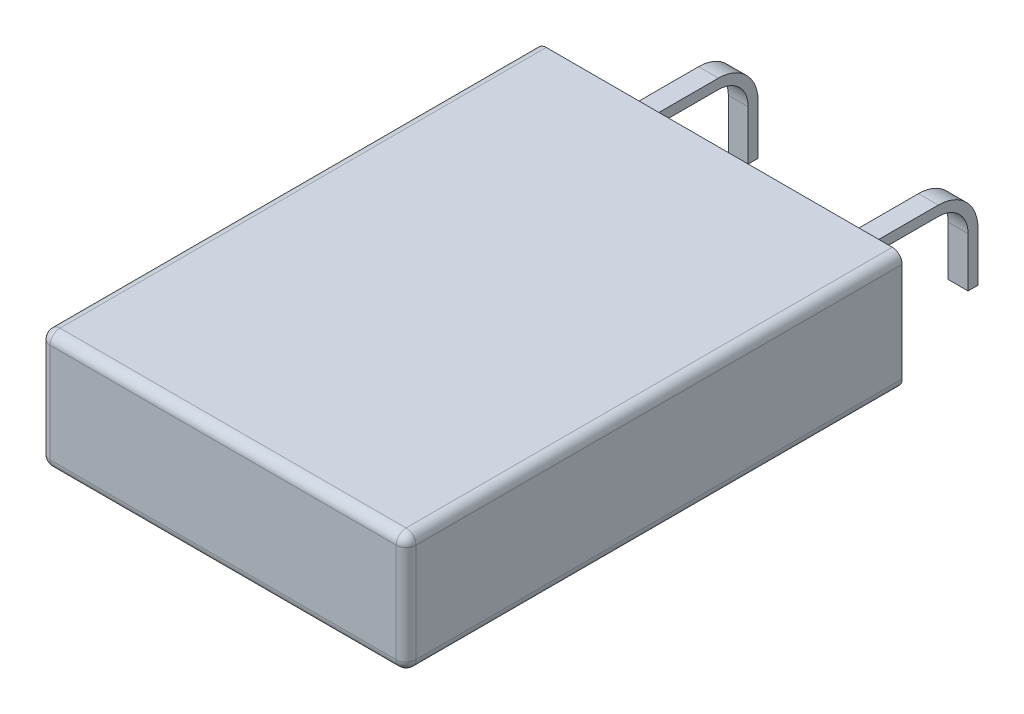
ISO-10303-21;
HEADER;
FILE_DESCRIPTION(('STEP AP214'),'2;1');
FILE_NAME('part.step','',(''),(''),'','','');
FILE_SCHEMA(('AUTOMOTIVE_DESIGN { 1 0 10303 214 1 1 1 1 }'));
ENDSEC;
DATA;
#1=APPLICATION_CONTEXT('core data for automotive mechanical design processes');
#2=APPLICATION_PROTOCOL_DEFINITION('international standard','automotive_design',2000,#1);
#3=PRODUCT_CONTEXT('',#1,'mechanical');
#4=PRODUCT('Part','Part','',(#3));
#5=PRODUCT_RELATED_PRODUCT_CATEGORY('part','',(#4));
#6=PRODUCT_DEFINITION_FORMATION('','',#4);
#7=PRODUCT_DEFINITION_CONTEXT('part definition',#1,'design');
#8=PRODUCT_DEFINITION('design','',#6,#7);
#9=PRODUCT_DEFINITION_SHAPE('','',#8);
#10=(LENGTH_UNIT() NAMED_UNIT(*) SI_UNIT(.MILLI.,.METRE.));
#11=(NAMED_UNIT(*) PLANE_ANGLE_UNIT() SI_UNIT($,.RADIAN.));
#12=(NAMED_UNIT(*) SI_UNIT($,.STERADIAN.) SOLID_ANGLE_UNIT());
#13=UNCERTAINTY_MEASURE_WITH_UNIT(LENGTH_MEASURE(1.E-05),#10,'distance_accuracy_value','');
#14=(GEOMETRIC_REPRESENTATION_CONTEXT(3) GLOBAL_UNCERTAINTY_ASSIGNED_CONTEXT((#13)) GLOBAL_UNIT_ASSIGNED_CONTEXT((#10,
#11,#12)) REPRESENTATION_CONTEXT('',''));
#15=CARTESIAN_POINT('',(0.,0.,0.));
#16=DIRECTION('',(0.,0.,1.));
#17=DIRECTION('',(1.,0.,0.));
#18=AXIS2_PLACEMENT_3D('',#15,#16,#17);
#19=CARTESIAN_POINT('',(17.94,5.5,-25.));
#20=DIRECTION('',(0.,0.,1.));
#21=DIRECTION('',(1.,0.,0.));
#22=AXIS2_PLACEMENT_3D('',#19,#20,#21);
#23=CYLINDRICAL_SURFACE('',#22,0.5);
#24=DIRECTION('',(0.,0.,1.));
#25=VECTOR('',#24,1.);
#26=CARTESIAN_POINT('',(17.94,6.,-25.));
#27=LINE('',#26,#25);
#28=CARTESIAN_POINT('',(17.94,6.,-25.));
#29=VERTEX_POINT('',#28);
#30=CARTESIAN_POINT('',(17.94,6.,-0.5));
#31=VERTEX_POINT('',#30);
#32=EDGE_CURVE('E423',#29,#31,#27,.T.);
#33=ORIENTED_EDGE('',*,*,#32,.T.);
#34=CARTESIAN_POINT('',(17.94,5.5,-0.5));
#35=DIRECTION('',(0.,0.,1.));
#36=DIRECTION('',(1.,0.,0.));
#37=AXIS2_PLACEMENT_3D('',#34,#35,#36);
#38=CIRCLE('',#37,0.5);
#39=CARTESIAN_POINT('',(18.44,5.5,-0.5));
#40=VERTEX_POINT('',#39);
#41=EDGE_CURVE('E427',#31,#40,#38,.F.);
#42=ORIENTED_EDGE('',*,*,#41,.T.);
#43=DIRECTION('',(0.,0.,1.));
#44=VECTOR('',#43,1.);
#45=CARTESIAN_POINT('',(18.44,5.5,-25.));
#46=LINE('',#45,#44);
#47=CARTESIAN_POINT('',(18.44,5.5,-25.));
#48=VERTEX_POINT('',#47);
#49=EDGE_CURVE('E424',#48,#40,#46,.T.);
#50=ORIENTED_EDGE('',*,*,#49,.F.);
#51=CARTESIAN_POINT('',(17.94,5.5,-25.));
#52=DIRECTION('',(0.,0.,1.));
#53=DIRECTION('',(-1.,0.,0.));
#54=AXIS2_PLACEMENT_3D('',#51,#52,#53);
#55=CIRCLE('',#54,0.5);
#56=EDGE_CURVE('E399',#48,#29,#55,.T.);
#57=ORIENTED_EDGE('',*,*,#56,.T.);
#58=EDGE_LOOP('',(#33,#42,#50,#57));
#59=FACE_BOUND('',#58,.T.);
#60=ADVANCED_FACE('F34',(#59),#23,.T.);
#61=CARTESIAN_POINT('',(18.44,0.500000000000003,-25.));
#62=DIRECTION('',(1.,0.,0.));
#63=DIRECTION('',(0.,0.,-1.));
#64=AXIS2_PLACEMENT_3D('',#61,#62,#63);
#65=PLANE('',#64);
#66=ORIENTED_EDGE('',*,*,#49,.T.);
#67=DIRECTION('',(0.,1.,0.));
#68=VECTOR('',#67,1.);
#69=CARTESIAN_POINT('',(18.44,0.500000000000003,-0.5));
#70=LINE('',#69,#68);
#71=CARTESIAN_POINT('',(18.44,0.500000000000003,-0.5));
#72=VERTEX_POINT('',#71);
#73=EDGE_CURVE('E459',#40,#72,#70,.F.);
#74=ORIENTED_EDGE('',*,*,#73,.T.);
#75=DIRECTION('',(0.,0.,1.));
#76=VECTOR('',#75,1.);
#77=CARTESIAN_POINT('',(18.44,0.500000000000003,-25.));
#78=LINE('',#77,#76);
#79=CARTESIAN_POINT('',(18.44,0.500000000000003,-25.));
#80=VERTEX_POINT('',#79);
#81=EDGE_CURVE('E428',#80,#72,#78,.T.);
#82=ORIENTED_EDGE('',*,*,#81,.F.);
#83=DIRECTION('',(0.,1.,0.));
#84=VECTOR('',#83,1.);
#85=CARTESIAN_POINT('',(18.44,0.500000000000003,-25.));
#86=LINE('',#85,#84);
#87=EDGE_CURVE('E420',#80,#48,#86,.T.);
#88=ORIENTED_EDGE('',*,*,#87,.T.);
#89=EDGE_LOOP('',(#66,#74,#82,#88));
#90=FACE_BOUND('',#89,.T.);
#91=ADVANCED_FACE('F536',(#90),#65,.T.);
#92=CARTESIAN_POINT('',(17.94,0.5,-25.));
#93=DIRECTION('',(0.,0.,1.));
#94=DIRECTION('',(1.,0.,0.));
#95=AXIS2_PLACEMENT_3D('',#92,#93,#94);
#96=CYLINDRICAL_SURFACE('',#95,0.5);
#97=ORIENTED_EDGE('',*,*,#81,.T.);
#98=CARTESIAN_POINT('',(17.94,0.5,-0.5));
#99=DIRECTION('',(0.,0.,1.));
#100=DIRECTION('',(1.,0.,0.));
#101=AXIS2_PLACEMENT_3D('',#98,#99,#100);
#102=CIRCLE('',#101,0.5);
#103=CARTESIAN_POINT('',(17.94,0.,-0.5));
#104=VERTEX_POINT('',#103);
#105=EDGE_CURVE('E461',#72,#104,#102,.F.);
#106=ORIENTED_EDGE('',*,*,#105,.T.);
#107=DIRECTION('',(0.,0.,1.));
#108=VECTOR('',#107,1.);
#109=CARTESIAN_POINT('',(17.94,0.,-25.));
#110=LINE('',#109,#108);
#111=CARTESIAN_POINT('',(17.94,0.,-25.));
#112=VERTEX_POINT('',#111);
#113=EDGE_CURVE('E431',#112,#104,#110,.T.);
#114=ORIENTED_EDGE('',*,*,#113,.F.);
#115=CARTESIAN_POINT('',(17.94,0.5,-25.));
#116=DIRECTION('',(0.,0.,1.));
#117=DIRECTION('',(1.,0.,0.));
#118=AXIS2_PLACEMENT_3D('',#115,#116,#117);
#119=CIRCLE('',#118,0.5);
#120=EDGE_CURVE('E417',#112,#80,#119,.T.);
#121=ORIENTED_EDGE('',*,*,#120,.T.);
#122=EDGE_LOOP('',(#97,#106,#114,#121));
#123=FACE_BOUND('',#122,.T.);
#124=ADVANCED_FACE('F542',(#123),#96,.T.);
#125=CARTESIAN_POINT('',(0.500000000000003,0.,-25.));
#126=DIRECTION('',(0.,-1.,0.));
#127=DIRECTION('',(0.,0.,-1.));
#128=AXIS2_PLACEMENT_3D('',#125,#126,#127);
#129=PLANE('',#128);
#130=ORIENTED_EDGE('',*,*,#113,.T.);
#131=DIRECTION('',(1.,0.,0.));
#132=VECTOR('',#131,1.);
#133=CARTESIAN_POINT('',(0.500000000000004,0.,-0.5));
#134=LINE('',#133,#132);
#135=CARTESIAN_POINT('',(0.500000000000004,0.,-0.5));
#136=VERTEX_POINT('',#135);
#137=EDGE_CURVE('E463',#104,#136,#134,.F.);
#138=ORIENTED_EDGE('',*,*,#137,.T.);
#139=DIRECTION('',(0.,0.,1.));
#140=VECTOR('',#139,1.);
#141=CARTESIAN_POINT('',(0.500000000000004,0.,-25.));
#142=LINE('',#141,#140);
#143=CARTESIAN_POINT('',(0.500000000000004,0.,-25.));
#144=VERTEX_POINT('',#143);
#145=EDGE_CURVE('E434',#144,#136,#142,.T.);
#146=ORIENTED_EDGE('',*,*,#145,.F.);
#147=DIRECTION('',(1.,0.,0.));
#148=VECTOR('',#147,1.);
#149=CARTESIAN_POINT('',(0.500000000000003,0.,-25.));
#150=LINE('',#149,#148);
#151=EDGE_CURVE('E414',#144,#112,#150,.T.);
#152=ORIENTED_EDGE('',*,*,#151,.T.);
#153=EDGE_LOOP('',(#130,#138,#146,#152));
#154=FACE_BOUND('',#153,.T.);
#155=ADVANCED_FACE('F541',(#154),#129,.T.);
#156=CARTESIAN_POINT('',(0.5,0.5,-25.));
#157=DIRECTION('',(0.,0.,1.));
#158=DIRECTION('',(1.,0.,0.));
#159=AXIS2_PLACEMENT_3D('',#156,#157,#158);
#160=CYLINDRICAL_SURFACE('',#159,0.5);
#161=ORIENTED_EDGE('',*,*,#145,.T.);
#162=CARTESIAN_POINT('',(0.5,0.5,-0.5));
#163=DIRECTION('',(0.,0.,1.));
#164=DIRECTION('',(1.,0.,0.));
#165=AXIS2_PLACEMENT_3D('',#162,#163,#164);
#166=CIRCLE('',#165,0.5);
#167=CARTESIAN_POINT('',(0.,0.500000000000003,-0.5));
#168=VERTEX_POINT('',#167);
#169=EDGE_CURVE('E465',#136,#168,#166,.F.);
#170=ORIENTED_EDGE('',*,*,#169,.T.);
#171=DIRECTION('',(0.,0.,1.));
#172=VECTOR('',#171,1.);
#173=CARTESIAN_POINT('',(0.,0.500000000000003,-25.));
#174=LINE('',#173,#172);
#175=CARTESIAN_POINT('',(0.,0.500000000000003,-25.));
#176=VERTEX_POINT('',#175);
#177=EDGE_CURVE('E437',#176,#168,#174,.T.);
#178=ORIENTED_EDGE('',*,*,#177,.F.);
#179=CARTESIAN_POINT('',(0.5,0.5,-25.));
#180=DIRECTION('',(0.,0.,1.));
#181=DIRECTION('',(-1.,0.,0.));
#182=AXIS2_PLACEMENT_3D('',#179,#180,#181);
#183=CIRCLE('',#182,0.5);
#184=EDGE_CURVE('E411',#176,#144,#183,.T.);
#185=ORIENTED_EDGE('',*,*,#184,.T.);
#186=EDGE_LOOP('',(#161,#170,#178,#185));
#187=FACE_BOUND('',#186,.T.);
#188=ADVANCED_FACE('F500',(#187),#160,.T.);
#189=CARTESIAN_POINT('',(0.,0.500000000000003,-25.));
#190=DIRECTION('',(-1.,0.,0.));
#191=DIRECTION('',(0.,0.,1.));
#192=AXIS2_PLACEMENT_3D('',#189,#190,#191);
#193=PLANE('',#192);
#194=ORIENTED_EDGE('',*,*,#177,.T.);
#195=DIRECTION('',(0.,-1.,0.));
#196=VECTOR('',#195,1.);
#197=CARTESIAN_POINT('',(0.,5.5,-0.5));
#198=LINE('',#197,#196);
#199=CARTESIAN_POINT('',(0.,5.5,-0.5));
#200=VERTEX_POINT('',#199);
#201=EDGE_CURVE('E467',#168,#200,#198,.F.);
#202=ORIENTED_EDGE('',*,*,#201,.T.);
#203=DIRECTION('',(0.,0.,1.));
#204=VECTOR('',#203,1.);
#205=CARTESIAN_POINT('',(0.,5.5,-25.));
#206=LINE('',#205,#204);
#207=CARTESIAN_POINT('',(0.,5.5,-25.));
#208=VERTEX_POINT('',#207);
#209=EDGE_CURVE('E440',#208,#200,#206,.T.);
#210=ORIENTED_EDGE('',*,*,#209,.F.);
#211=DIRECTION('',(0.,-1.,0.));
#212=VECTOR('',#211,1.);
#213=CARTESIAN_POINT('',(0.,0.500000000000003,-25.));
#214=LINE('',#213,#212);
#215=EDGE_CURVE('E408',#208,#176,#214,.T.);
#216=ORIENTED_EDGE('',*,*,#215,.T.);
#217=EDGE_LOOP('',(#194,#202,#210,#216));
#218=FACE_BOUND('',#217,.T.);
#219=ADVANCED_FACE('F503',(#218),#193,.T.);
#220=CARTESIAN_POINT('',(0.5,5.5,-25.));
#221=DIRECTION('',(0.,0.,1.));
#222=DIRECTION('',(1.,0.,0.));
#223=AXIS2_PLACEMENT_3D('',#220,#221,#222);
#224=CYLINDRICAL_SURFACE('',#223,0.5);
#225=ORIENTED_EDGE('',*,*,#209,.T.);
#226=CARTESIAN_POINT('',(0.5,5.5,-0.5));
#227=DIRECTION('',(0.,0.,1.));
#228=DIRECTION('',(1.,0.,0.));
#229=AXIS2_PLACEMENT_3D('',#226,#227,#228);
#230=CIRCLE('',#229,0.5);
#231=CARTESIAN_POINT('',(0.500000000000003,6.,-0.5));
#232=VERTEX_POINT('',#231);
#233=EDGE_CURVE('E43',#200,#232,#230,.F.);
#234=ORIENTED_EDGE('',*,*,#233,.T.);
#235=DIRECTION('',(0.,0.,1.));
#236=VECTOR('',#235,1.);
#237=CARTESIAN_POINT('',(0.500000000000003,6.,-25.));
#238=LINE('',#237,#236);
#239=CARTESIAN_POINT('',(0.500000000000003,6.,-25.));
#240=VERTEX_POINT('',#239);
#241=EDGE_CURVE('E443',#240,#232,#238,.T.);
#242=ORIENTED_EDGE('',*,*,#241,.F.);
#243=CARTESIAN_POINT('',(0.5,5.5,-25.));
#244=DIRECTION('',(0.,0.,1.));
#245=DIRECTION('',(-1.,0.,0.));
#246=AXIS2_PLACEMENT_3D('',#243,#244,#245);
#247=CIRCLE('',#246,0.5);
#248=EDGE_CURVE('E405',#240,#208,#247,.T.);
#249=ORIENTED_EDGE('',*,*,#248,.T.);
#250=EDGE_LOOP('',(#225,#234,#242,#249));
#251=FACE_BOUND('',#250,.T.);
#252=ADVANCED_FACE('F512',(#251),#224,.T.);
#253=CARTESIAN_POINT('',(0.500000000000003,6.,-25.));
#254=DIRECTION('',(0.,1.,0.));
#255=DIRECTION('',(0.,0.,1.));
#256=AXIS2_PLACEMENT_3D('',#253,#254,#255);
#257=PLANE('',#256);
#258=ORIENTED_EDGE('',*,*,#241,.T.);
#259=DIRECTION('',(-1.,0.,0.));
#260=VECTOR('',#259,1.);
#261=CARTESIAN_POINT('',(17.94,6.,-0.5));
#262=LINE('',#261,#260);
#263=EDGE_CURVE('E11',#232,#31,#262,.F.);
#264=ORIENTED_EDGE('',*,*,#263,.T.);
#265=ORIENTED_EDGE('',*,*,#32,.F.);
#266=DIRECTION('',(-1.,0.,0.));
#267=VECTOR('',#266,1.);
#268=CARTESIAN_POINT('',(0.500000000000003,6.,-25.));
#269=LINE('',#268,#267);
#270=EDGE_CURVE('E402',#29,#240,#269,.T.);
#271=ORIENTED_EDGE('',*,*,#270,.T.);
#272=EDGE_LOOP('',(#258,#264,#265,#271));
#273=FACE_BOUND('',#272,.T.);
#274=ADVANCED_FACE('F517',(#273),#257,.T.);
#275=CARTESIAN_POINT('',(17.94,5.5,-25.));
#276=DIRECTION('',(0.,0.,-1.));
#277=DIRECTION('',(-1.,0.,0.));
#278=AXIS2_PLACEMENT_3D('',#275,#276,#277);
#279=PLANE('',#278);
#280=DIRECTION('',(1.,0.,0.));
#281=VECTOR('',#280,1.);
#282=CARTESIAN_POINT('',(1.,5.,-25.));
#283=LINE('',#282,#281);
#284=CARTESIAN_POINT('',(1.,5.,-25.));
#285=VERTEX_POINT('',#284);
#286=CARTESIAN_POINT('',(17.44,5.,-25.));
#287=VERTEX_POINT('',#286);
#288=EDGE_CURVE('E366',#285,#287,#283,.T.);
#289=ORIENTED_EDGE('',*,*,#288,.F.);
#290=DIRECTION('',(0.,1.,0.));
#291=VECTOR('',#290,1.);
#292=CARTESIAN_POINT('',(1.,1.,-25.));
#293=LINE('',#292,#291);
#294=CARTESIAN_POINT('',(1.,1.,-25.));
#295=VERTEX_POINT('',#294);
#296=EDGE_CURVE('E371',#295,#285,#293,.T.);
#297=ORIENTED_EDGE('',*,*,#296,.F.);
#298=DIRECTION('',(-1.,0.,0.));
#299=VECTOR('',#298,1.);
#300=CARTESIAN_POINT('',(17.44,1.,-25.));
#301=LINE('',#300,#299);
#302=CARTESIAN_POINT('',(17.44,1.,-25.));
#303=VERTEX_POINT('',#302);
#304=EDGE_CURVE('E385',#303,#295,#301,.T.);
#305=ORIENTED_EDGE('',*,*,#304,.F.);
#306=DIRECTION('',(0.,-1.,0.));
#307=VECTOR('',#306,1.);
#308=CARTESIAN_POINT('',(17.44,5.,-25.));
#309=LINE('',#308,#307);
#310=EDGE_CURVE('E382',#287,#303,#309,.T.);
#311=ORIENTED_EDGE('',*,*,#310,.F.);
#312=EDGE_LOOP('',(#289,#297,#305,#311));
#313=FACE_BOUND('',#312,.T.);
#314=ORIENTED_EDGE('',*,*,#56,.F.);
#315=ORIENTED_EDGE('',*,*,#87,.F.);
#316=ORIENTED_EDGE('',*,*,#120,.F.);
#317=ORIENTED_EDGE('',*,*,#151,.F.);
#318=ORIENTED_EDGE('',*,*,#184,.F.);
#319=ORIENTED_EDGE('',*,*,#215,.F.);
#320=ORIENTED_EDGE('',*,*,#248,.F.);
#321=ORIENTED_EDGE('',*,*,#270,.F.);
#322=EDGE_LOOP('',(#314,#315,#316,#317,#318,#319,#320,#321));
#323=FACE_BOUND('',#322,.T.);
#324=ADVANCED_FACE('F508',(#313,#323),#279,.T.);
#325=CARTESIAN_POINT('',(17.94,5.5,0.));
#326=DIRECTION('',(0.,0.,-1.));
#327=DIRECTION('',(-1.,0.,0.));
#328=AXIS2_PLACEMENT_3D('',#325,#326,#327);
#329=PLANE('',#328);
#330=DIRECTION('',(1.,0.,0.));
#331=VECTOR('',#330,1.);
#332=CARTESIAN_POINT('',(17.94,0.5,0.));
#333=LINE('',#332,#331);
#334=CARTESIAN_POINT('',(0.5,0.5,0.));
#335=VERTEX_POINT('',#334);
#336=CARTESIAN_POINT('',(17.94,0.5,0.));
#337=VERTEX_POINT('',#336);
#338=EDGE_CURVE('E454',#335,#337,#333,.T.);
#339=ORIENTED_EDGE('',*,*,#338,.T.);
#340=DIRECTION('',(0.,1.,0.));
#341=VECTOR('',#340,1.);
#342=CARTESIAN_POINT('',(17.94,5.5,0.));
#343=LINE('',#342,#341);
#344=CARTESIAN_POINT('',(17.94,5.5,0.));
#345=VERTEX_POINT('',#344);
#346=EDGE_CURVE('E456',#337,#345,#343,.T.);
#347=ORIENTED_EDGE('',*,*,#346,.T.);
#348=DIRECTION('',(-1.,0.,0.));
#349=VECTOR('',#348,1.);
#350=CARTESIAN_POINT('',(0.500000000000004,5.5,0.));
#351=LINE('',#350,#349);
#352=CARTESIAN_POINT('',(0.5,5.5,0.));
#353=VERTEX_POINT('',#352);
#354=EDGE_CURVE('E450',#345,#353,#351,.T.);
#355=ORIENTED_EDGE('',*,*,#354,.T.);
#356=DIRECTION('',(0.,-1.,0.));
#357=VECTOR('',#356,1.);
#358=CARTESIAN_POINT('',(0.5,0.500000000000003,0.));
#359=LINE('',#358,#357);
#360=EDGE_CURVE('E452',#353,#335,#359,.T.);
#361=ORIENTED_EDGE('',*,*,#360,.T.);
#362=EDGE_LOOP('',(#339,#347,#355,#361));
#363=FACE_BOUND('',#362,.T.);
#364=ADVANCED_FACE('F864',(#363),#329,.F.);
#365=CARTESIAN_POINT('',(0.5,0.5,-0.5));
#366=DIRECTION('',(0.,0.,1.));
#367=DIRECTION('',(1.,0.,0.));
#368=AXIS2_PLACEMENT_3D('',#365,#366,#367);
#369=SPHERICAL_SURFACE('',#368,0.5);
#370=CARTESIAN_POINT('',(0.5,0.5,-0.5));
#371=DIRECTION('',(0.,1.,0.));
#372=DIRECTION('',(-1.,0.,0.));
#373=AXIS2_PLACEMENT_3D('',#370,#371,#372);
#374=CIRCLE('',#373,0.5);
#375=EDGE_CURVE('E484',#168,#335,#374,.T.);
#376=ORIENTED_EDGE('',*,*,#375,.F.);
#377=ORIENTED_EDGE('',*,*,#169,.F.);
#378=CARTESIAN_POINT('',(0.5,0.5,-0.5));
#379=DIRECTION('',(1.,0.,0.));
#380=DIRECTION('',(0.,1.,0.));
#381=AXIS2_PLACEMENT_3D('',#378,#379,#380);
#382=CIRCLE('',#381,0.5);
#383=EDGE_CURVE('E38',#335,#136,#382,.T.);
#384=ORIENTED_EDGE('',*,*,#383,.F.);
#385=EDGE_LOOP('',(#376,#377,#384));
#386=FACE_BOUND('',#385,.T.);
#387=ADVANCED_FACE('F36',(#386),#369,.T.);
#388=CARTESIAN_POINT('',(17.94,0.5,-0.5));
#389=DIRECTION('',(-1.,0.,0.));
#390=DIRECTION('',(0.,0.,1.));
#391=AXIS2_PLACEMENT_3D('',#388,#389,#390);
#392=CYLINDRICAL_SURFACE('',#391,0.5);
#393=ORIENTED_EDGE('',*,*,#383,.T.);
#394=ORIENTED_EDGE('',*,*,#137,.F.);
#395=CARTESIAN_POINT('',(17.94,0.5,-0.5));
#396=DIRECTION('',(1.,0.,0.));
#397=DIRECTION('',(0.,1.,0.));
#398=AXIS2_PLACEMENT_3D('',#395,#396,#397);
#399=CIRCLE('',#398,0.5);
#400=EDGE_CURVE('E482',#337,#104,#399,.T.);
#401=ORIENTED_EDGE('',*,*,#400,.F.);
#402=ORIENTED_EDGE('',*,*,#338,.F.);
#403=EDGE_LOOP('',(#393,#394,#401,#402));
#404=FACE_BOUND('',#403,.T.);
#405=ADVANCED_FACE('F495',(#404),#392,.T.);
#406=CARTESIAN_POINT('',(0.5,5.5,-0.5));
#407=DIRECTION('',(0.,1.,0.));
#408=DIRECTION('',(0.,0.,1.));
#409=AXIS2_PLACEMENT_3D('',#406,#407,#408);
#410=CYLINDRICAL_SURFACE('',#409,0.5);
#411=ORIENTED_EDGE('',*,*,#375,.T.);
#412=ORIENTED_EDGE('',*,*,#360,.F.);
#413=CARTESIAN_POINT('',(0.5,5.5,-0.5));
#414=DIRECTION('',(0.,1.,0.));
#415=DIRECTION('',(0.,0.,1.));
#416=AXIS2_PLACEMENT_3D('',#413,#414,#415);
#417=CIRCLE('',#416,0.5);
#418=EDGE_CURVE('E479',#200,#353,#417,.T.);
#419=ORIENTED_EDGE('',*,*,#418,.F.);
#420=ORIENTED_EDGE('',*,*,#201,.F.);
#421=EDGE_LOOP('',(#411,#412,#419,#420));
#422=FACE_BOUND('',#421,.T.);
#423=ADVANCED_FACE('F547',(#422),#410,.T.);
#424=CARTESIAN_POINT('',(17.94,0.5,-0.5));
#425=DIRECTION('',(0.,0.,1.));
#426=DIRECTION('',(1.,0.,0.));
#427=AXIS2_PLACEMENT_3D('',#424,#425,#426);
#428=SPHERICAL_SURFACE('',#427,0.5);
#429=ORIENTED_EDGE('',*,*,#400,.T.);
#430=ORIENTED_EDGE('',*,*,#105,.F.);
#431=CARTESIAN_POINT('',(17.94,0.5,-0.5));
#432=DIRECTION('',(0.,1.,0.));
#433=DIRECTION('',(-1.,0.,0.));
#434=AXIS2_PLACEMENT_3D('',#431,#432,#433);
#435=CIRCLE('',#434,0.5);
#436=EDGE_CURVE('E476',#337,#72,#435,.T.);
#437=ORIENTED_EDGE('',*,*,#436,.F.);
#438=EDGE_LOOP('',(#429,#430,#437));
#439=FACE_BOUND('',#438,.T.);
#440=ADVANCED_FACE('F545',(#439),#428,.T.);
#441=CARTESIAN_POINT('',(0.5,5.5,-0.5));
#442=DIRECTION('',(0.,0.,1.));
#443=DIRECTION('',(1.,0.,0.));
#444=AXIS2_PLACEMENT_3D('',#441,#442,#443);
#445=SPHERICAL_SURFACE('',#444,0.5);
#446=ORIENTED_EDGE('',*,*,#233,.F.);
#447=ORIENTED_EDGE('',*,*,#418,.T.);
#448=CARTESIAN_POINT('',(0.5,5.5,-0.5));
#449=DIRECTION('',(1.,0.,0.));
#450=DIRECTION('',(0.,1.,0.));
#451=AXIS2_PLACEMENT_3D('',#448,#449,#450);
#452=CIRCLE('',#451,0.5);
#453=EDGE_CURVE('E473',#232,#353,#452,.T.);
#454=ORIENTED_EDGE('',*,*,#453,.F.);
#455=EDGE_LOOP('',(#446,#447,#454));
#456=FACE_BOUND('',#455,.T.);
#457=ADVANCED_FACE('F520',(#456),#445,.T.);
#458=CARTESIAN_POINT('',(17.94,5.5,-0.5));
#459=DIRECTION('',(0.,-1.,0.));
#460=DIRECTION('',(0.,0.,-1.));
#461=AXIS2_PLACEMENT_3D('',#458,#459,#460);
#462=CYLINDRICAL_SURFACE('',#461,0.5);
#463=ORIENTED_EDGE('',*,*,#436,.T.);
#464=ORIENTED_EDGE('',*,*,#73,.F.);
#465=CARTESIAN_POINT('',(17.94,5.5,-0.5));
#466=DIRECTION('',(0.,1.,0.));
#467=DIRECTION('',(-1.,0.,0.));
#468=AXIS2_PLACEMENT_3D('',#465,#466,#467);
#469=CIRCLE('',#468,0.5);
#470=EDGE_CURVE('E471',#345,#40,#469,.T.);
#471=ORIENTED_EDGE('',*,*,#470,.F.);
#472=ORIENTED_EDGE('',*,*,#346,.F.);
#473=EDGE_LOOP('',(#463,#464,#471,#472));
#474=FACE_BOUND('',#473,.T.);
#475=ADVANCED_FACE('F532',(#474),#462,.T.);
#476=CARTESIAN_POINT('',(17.94,5.5,-0.5));
#477=DIRECTION('',(1.,0.,0.));
#478=DIRECTION('',(0.,0.,-1.));
#479=AXIS2_PLACEMENT_3D('',#476,#477,#478);
#480=CYLINDRICAL_SURFACE('',#479,0.5);
#481=ORIENTED_EDGE('',*,*,#453,.T.);
#482=ORIENTED_EDGE('',*,*,#354,.F.);
#483=CARTESIAN_POINT('',(17.94,5.5,-0.5));
#484=DIRECTION('',(1.,0.,0.));
#485=DIRECTION('',(0.,0.,-1.));
#486=AXIS2_PLACEMENT_3D('',#483,#484,#485);
#487=CIRCLE('',#486,0.5);
#488=EDGE_CURVE('E392',#31,#345,#487,.T.);
#489=ORIENTED_EDGE('',*,*,#488,.F.);
#490=ORIENTED_EDGE('',*,*,#263,.F.);
#491=EDGE_LOOP('',(#481,#482,#489,#490));
#492=FACE_BOUND('',#491,.T.);
#493=ADVANCED_FACE('F524',(#492),#480,.T.);
#494=CARTESIAN_POINT('',(17.94,5.5,-0.5));
#495=DIRECTION('',(0.,0.,1.));
#496=DIRECTION('',(1.,0.,0.));
#497=AXIS2_PLACEMENT_3D('',#494,#495,#496);
#498=SPHERICAL_SURFACE('',#497,0.5);
#499=ORIENTED_EDGE('',*,*,#470,.T.);
#500=ORIENTED_EDGE('',*,*,#41,.F.);
#501=ORIENTED_EDGE('',*,*,#488,.T.);
#502=EDGE_LOOP('',(#499,#500,#501));
#503=FACE_BOUND('',#502,.T.);
#504=ADVANCED_FACE('F528',(#503),#498,.T.);
#505=CARTESIAN_POINT('',(1.,5.,-20.));
#506=DIRECTION('',(0.,1.,0.));
#507=DIRECTION('',(0.,0.,1.));
#508=AXIS2_PLACEMENT_3D('',#505,#506,#507);
#509=PLANE('',#508);
#510=ORIENTED_EDGE('',*,*,#288,.T.);
#511=DIRECTION('',(0.,0.,-1.));
#512=VECTOR('',#511,1.);
#513=CARTESIAN_POINT('',(17.44,5.,-20.));
#514=LINE('',#513,#512);
#515=CARTESIAN_POINT('',(17.44,5.,-20.));
#516=VERTEX_POINT('',#515);
#517=EDGE_CURVE('E380',#516,#287,#514,.T.);
#518=ORIENTED_EDGE('',*,*,#517,.F.);
#519=DIRECTION('',(1.,0.,0.));
#520=VECTOR('',#519,1.);
#521=CARTESIAN_POINT('',(1.,5.,-20.));
#522=LINE('',#521,#520);
#523=CARTESIAN_POINT('',(1.,5.,-20.));
#524=VERTEX_POINT('',#523);
#525=EDGE_CURVE('E367',#524,#516,#522,.T.);
#526=ORIENTED_EDGE('',*,*,#525,.F.);
#527=DIRECTION('',(0.,0.,-1.));
#528=VECTOR('',#527,1.);
#529=CARTESIAN_POINT('',(1.,5.,-20.));
#530=LINE('',#529,#528);
#531=EDGE_CURVE('E390',#524,#285,#530,.T.);
#532=ORIENTED_EDGE('',*,*,#531,.T.);
#533=EDGE_LOOP('',(#510,#518,#526,#532));
#534=FACE_BOUND('',#533,.T.);
#535=ADVANCED_FACE('F566',(#534),#509,.F.);
#536=CARTESIAN_POINT('',(1.,1.,-20.));
#537=DIRECTION('',(-1.,0.,0.));
#538=DIRECTION('',(0.,0.,1.));
#539=AXIS2_PLACEMENT_3D('',#536,#537,#538);
#540=PLANE('',#539);
#541=ORIENTED_EDGE('',*,*,#296,.T.);
#542=ORIENTED_EDGE('',*,*,#531,.F.);
#543=DIRECTION('',(0.,1.,0.));
#544=VECTOR('',#543,1.);
#545=CARTESIAN_POINT('',(1.,1.,-20.));
#546=LINE('',#545,#544);
#547=CARTESIAN_POINT('',(1.,1.,-20.));
#548=VERTEX_POINT('',#547);
#549=EDGE_CURVE('E377',#548,#524,#546,.T.);
#550=ORIENTED_EDGE('',*,*,#549,.F.);
#551=DIRECTION('',(0.,0.,-1.));
#552=VECTOR('',#551,1.);
#553=CARTESIAN_POINT('',(1.,1.,-20.));
#554=LINE('',#553,#552);
#555=EDGE_CURVE('E393',#548,#295,#554,.T.);
#556=ORIENTED_EDGE('',*,*,#555,.T.);
#557=EDGE_LOOP('',(#541,#542,#550,#556));
#558=FACE_BOUND('',#557,.T.);
#559=ADVANCED_FACE('F589',(#558),#540,.F.);
#560=CARTESIAN_POINT('',(17.44,1.,-20.));
#561=DIRECTION('',(0.,-1.,0.));
#562=DIRECTION('',(0.,0.,-1.));
#563=AXIS2_PLACEMENT_3D('',#560,#561,#562);
#564=PLANE('',#563);
#565=ORIENTED_EDGE('',*,*,#304,.T.);
#566=ORIENTED_EDGE('',*,*,#555,.F.);
#567=DIRECTION('',(-1.,0.,0.));
#568=VECTOR('',#567,1.);
#569=CARTESIAN_POINT('',(17.44,1.,-20.));
#570=LINE('',#569,#568);
#571=CARTESIAN_POINT('',(17.44,1.,-20.));
#572=VERTEX_POINT('',#571);
#573=EDGE_CURVE('E374',#572,#548,#570,.T.);
#574=ORIENTED_EDGE('',*,*,#573,.F.);
#575=DIRECTION('',(0.,0.,-1.));
#576=VECTOR('',#575,1.);
#577=CARTESIAN_POINT('',(17.44,1.,-20.));
#578=LINE('',#577,#576);
#579=EDGE_CURVE('E395',#572,#303,#578,.T.);
#580=ORIENTED_EDGE('',*,*,#579,.T.);
#581=EDGE_LOOP('',(#565,#566,#574,#580));
#582=FACE_BOUND('',#581,.T.);
#583=ADVANCED_FACE('F597',(#582),#564,.F.);
#584=CARTESIAN_POINT('',(17.44,5.,-20.));
#585=DIRECTION('',(1.,0.,0.));
#586=DIRECTION('',(0.,0.,-1.));
#587=AXIS2_PLACEMENT_3D('',#584,#585,#586);
#588=PLANE('',#587);
#589=ORIENTED_EDGE('',*,*,#310,.T.);
#590=ORIENTED_EDGE('',*,*,#579,.F.);
#591=DIRECTION('',(0.,-1.,0.));
#592=VECTOR('',#591,1.);
#593=CARTESIAN_POINT('',(17.44,5.,-20.));
#594=LINE('',#593,#592);
#595=EDGE_CURVE('E370',#516,#572,#594,.T.);
#596=ORIENTED_EDGE('',*,*,#595,.F.);
#597=ORIENTED_EDGE('',*,*,#517,.T.);
#598=EDGE_LOOP('',(#589,#590,#596,#597));
#599=FACE_BOUND('',#598,.T.);
#600=ADVANCED_FACE('F605',(#599),#588,.F.);
#601=CARTESIAN_POINT('',(17.44,5.,-20.));
#602=DIRECTION('',(0.,0.,-1.));
#603=DIRECTION('',(-1.,0.,0.));
#604=AXIS2_PLACEMENT_3D('',#601,#602,#603);
#605=PLANE('',#604);
#606=DIRECTION('',(1.,0.,0.));
#607=VECTOR('',#606,1.);
#608=CARTESIAN_POINT('',(3.18,4.,-20.));
#609=LINE('',#608,#607);
#610=CARTESIAN_POINT('',(3.18,4.,-20.));
#611=VERTEX_POINT('',#610);
#612=CARTESIAN_POINT('',(4.18,4.,-20.));
#613=VERTEX_POINT('',#612);
#614=EDGE_CURVE('E51',#611,#613,#609,.T.);
#615=ORIENTED_EDGE('',*,*,#614,.F.);
#616=DIRECTION('',(0.,1.,0.));
#617=VECTOR('',#616,1.);
#618=CARTESIAN_POINT('',(3.18,4.,-20.));
#619=LINE('',#618,#617);
#620=CARTESIAN_POINT('',(3.18,3.5,-20.));
#621=VERTEX_POINT('',#620);
#622=EDGE_CURVE('E252',#621,#611,#619,.T.);
#623=ORIENTED_EDGE('',*,*,#622,.F.);
#624=DIRECTION('',(-1.,0.,0.));
#625=VECTOR('',#624,1.);
#626=CARTESIAN_POINT('',(3.18,3.5,-20.));
#627=LINE('',#626,#625);
#628=CARTESIAN_POINT('',(4.18,3.5,-20.));
#629=VERTEX_POINT('',#628);
#630=EDGE_CURVE('E957',#629,#621,#627,.T.);
#631=ORIENTED_EDGE('',*,*,#630,.F.);
#632=DIRECTION('',(0.,-1.,0.));
#633=VECTOR('',#632,1.);
#634=CARTESIAN_POINT('',(4.18,4.,-20.));
#635=LINE('',#634,#633);
#636=EDGE_CURVE('E56',#613,#629,#635,.T.);
#637=ORIENTED_EDGE('',*,*,#636,.F.);
#638=EDGE_LOOP('',(#615,#623,#631,#637));
#639=FACE_BOUND('',#638,.T.);
#640=DIRECTION('',(0.,-1.,0.));
#641=VECTOR('',#640,1.);
#642=CARTESIAN_POINT('',(15.26,4.,-20.));
#643=LINE('',#642,#641);
#644=CARTESIAN_POINT('',(15.26,4.,-20.));
#645=VERTEX_POINT('',#644);
#646=CARTESIAN_POINT('',(15.26,3.5,-20.));
#647=VERTEX_POINT('',#646);
#648=EDGE_CURVE('E294',#645,#647,#643,.T.);
#649=ORIENTED_EDGE('',*,*,#648,.F.);
#650=DIRECTION('',(1.,0.,0.));
#651=VECTOR('',#650,1.);
#652=CARTESIAN_POINT('',(15.26,4.,-20.));
#653=LINE('',#652,#651);
#654=CARTESIAN_POINT('',(14.26,4.,-20.));
#655=VERTEX_POINT('',#654);
#656=EDGE_CURVE('E299',#655,#645,#653,.T.);
#657=ORIENTED_EDGE('',*,*,#656,.F.);
#658=DIRECTION('',(0.,1.,0.));
#659=VECTOR('',#658,1.);
#660=CARTESIAN_POINT('',(14.26,4.,-20.));
#661=LINE('',#660,#659);
#662=CARTESIAN_POINT('',(14.26,3.5,-20.));
#663=VERTEX_POINT('',#662);
#664=EDGE_CURVE('E308',#663,#655,#661,.T.);
#665=ORIENTED_EDGE('',*,*,#664,.F.);
#666=DIRECTION('',(-1.,0.,0.));
#667=VECTOR('',#666,1.);
#668=CARTESIAN_POINT('',(15.26,3.5,-20.));
#669=LINE('',#668,#667);
#670=EDGE_CURVE('E305',#647,#663,#669,.T.);
#671=ORIENTED_EDGE('',*,*,#670,.F.);
#672=EDGE_LOOP('',(#649,#657,#665,#671));
#673=FACE_BOUND('',#672,.T.);
#674=ORIENTED_EDGE('',*,*,#525,.T.);
#675=ORIENTED_EDGE('',*,*,#595,.T.);
#676=ORIENTED_EDGE('',*,*,#573,.T.);
#677=ORIENTED_EDGE('',*,*,#549,.T.);
#678=EDGE_LOOP('',(#674,#675,#676,#677));
#679=FACE_BOUND('',#678,.T.);
#680=ADVANCED_FACE('F613',(#639,#673,#679),#605,.T.);
#681=CARTESIAN_POINT('',(15.26,1.99999999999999,-31.5));
#682=DIRECTION('',(0.,0.,1.));
#683=DIRECTION('',(1.,0.,0.));
#684=AXIS2_PLACEMENT_3D('',#681,#682,#683);
#685=PLANE('',#684);
#686=DIRECTION('',(-1.,0.,0.));
#687=VECTOR('',#686,1.);
#688=CARTESIAN_POINT('',(15.26,1.99999999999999,-31.5));
#689=LINE('',#688,#687);
#690=CARTESIAN_POINT('',(15.26,1.99999999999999,-31.5));
#691=VERTEX_POINT('',#690);
#692=CARTESIAN_POINT('',(14.26,1.99999999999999,-31.5));
#693=VERTEX_POINT('',#692);
#694=EDGE_CURVE('E327',#691,#693,#689,.T.);
#695=ORIENTED_EDGE('',*,*,#694,.T.);
#696=DIRECTION('',(0.,-1.,0.));
#697=VECTOR('',#696,1.);
#698=CARTESIAN_POINT('',(14.26,1.99999999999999,-31.5));
#699=LINE('',#698,#697);
#700=CARTESIAN_POINT('',(14.26,-0.499999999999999,-31.5));
#701=VERTEX_POINT('',#700);
#702=EDGE_CURVE('E360',#693,#701,#699,.T.);
#703=ORIENTED_EDGE('',*,*,#702,.T.);
#704=DIRECTION('',(-1.,0.,0.));
#705=VECTOR('',#704,1.);
#706=CARTESIAN_POINT('',(15.26,-0.499999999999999,-31.5));
#707=LINE('',#706,#705);
#708=CARTESIAN_POINT('',(15.26,-0.499999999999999,-31.5));
#709=VERTEX_POINT('',#708);
#710=EDGE_CURVE('E351',#709,#701,#707,.T.);
#711=ORIENTED_EDGE('',*,*,#710,.F.);
#712=DIRECTION('',(0.,-1.,0.));
#713=VECTOR('',#712,1.);
#714=CARTESIAN_POINT('',(15.26,1.99999999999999,-31.5));
#715=LINE('',#714,#713);
#716=EDGE_CURVE('E363',#691,#709,#715,.T.);
#717=ORIENTED_EDGE('',*,*,#716,.F.);
#718=EDGE_LOOP('',(#695,#703,#711,#717));
#719=FACE_BOUND('',#718,.T.);
#720=ADVANCED_FACE('F622',(#719),#685,.T.);
#721=CARTESIAN_POINT('',(15.26,1.99999999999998,-32.));
#722=DIRECTION('',(0.,0.,-1.));
#723=DIRECTION('',(-1.,0.,0.));
#724=AXIS2_PLACEMENT_3D('',#721,#722,#723);
#725=PLANE('',#724);
#726=DIRECTION('',(1.,0.,0.));
#727=VECTOR('',#726,1.);
#728=CARTESIAN_POINT('',(15.26,1.99999999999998,-32.));
#729=LINE('',#728,#727);
#730=CARTESIAN_POINT('',(14.26,1.99999999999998,-32.));
#731=VERTEX_POINT('',#730);
#732=CARTESIAN_POINT('',(15.26,1.99999999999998,-32.));
#733=VERTEX_POINT('',#732);
#734=EDGE_CURVE('E324',#731,#733,#729,.T.);
#735=ORIENTED_EDGE('',*,*,#734,.T.);
#736=DIRECTION('',(0.,-1.,0.));
#737=VECTOR('',#736,1.);
#738=CARTESIAN_POINT('',(15.26,1.99999999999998,-32.));
#739=LINE('',#738,#737);
#740=CARTESIAN_POINT('',(15.26,-0.500000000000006,-32.));
#741=VERTEX_POINT('',#740);
#742=EDGE_CURVE('E354',#733,#741,#739,.T.);
#743=ORIENTED_EDGE('',*,*,#742,.T.);
#744=DIRECTION('',(1.,0.,0.));
#745=VECTOR('',#744,1.);
#746=CARTESIAN_POINT('',(15.26,-0.500000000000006,-32.));
#747=LINE('',#746,#745);
#748=CARTESIAN_POINT('',(14.26,-0.500000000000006,-32.));
#749=VERTEX_POINT('',#748);
#750=EDGE_CURVE('E345',#749,#741,#747,.T.);
#751=ORIENTED_EDGE('',*,*,#750,.F.);
#752=DIRECTION('',(0.,-1.,0.));
#753=VECTOR('',#752,1.);
#754=CARTESIAN_POINT('',(14.26,1.99999999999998,-32.));
#755=LINE('',#754,#753);
#756=EDGE_CURVE('E357',#731,#749,#755,.T.);
#757=ORIENTED_EDGE('',*,*,#756,.F.);
#758=EDGE_LOOP('',(#735,#743,#751,#757));
#759=FACE_BOUND('',#758,.T.);
#760=ADVANCED_FACE('F628',(#759),#725,.T.);
#761=CARTESIAN_POINT('',(9.22,2.,-30.));
#762=DIRECTION('',(-1.,0.,0.));
#763=DIRECTION('',(0.,0.,1.));
#764=AXIS2_PLACEMENT_3D('',#761,#762,#763);
#765=CYLINDRICAL_SURFACE('',#764,1.5);
#766=DIRECTION('',(-1.,0.,0.));
#767=VECTOR('',#766,1.);
#768=CARTESIAN_POINT('',(15.26,3.5,-30.));
#769=LINE('',#768,#767);
#770=CARTESIAN_POINT('',(15.26,3.5,-30.));
#771=VERTEX_POINT('',#770);
#772=CARTESIAN_POINT('',(14.26,3.5,-30.));
#773=VERTEX_POINT('',#772);
#774=EDGE_CURVE('E295',#771,#773,#769,.T.);
#775=ORIENTED_EDGE('',*,*,#774,.T.);
#776=CARTESIAN_POINT('',(14.26,2.,-30.));
#777=DIRECTION('',(-1.,0.,0.));
#778=DIRECTION('',(0.,0.,1.));
#779=AXIS2_PLACEMENT_3D('',#776,#777,#778);
#780=CIRCLE('',#779,1.5);
#781=EDGE_CURVE('E336',#773,#693,#780,.T.);
#782=ORIENTED_EDGE('',*,*,#781,.T.);
#783=ORIENTED_EDGE('',*,*,#694,.F.);
#784=CARTESIAN_POINT('',(15.26,2.,-30.));
#785=DIRECTION('',(-1.,0.,0.));
#786=DIRECTION('',(0.,0.,1.));
#787=AXIS2_PLACEMENT_3D('',#784,#785,#786);
#788=CIRCLE('',#787,1.5);
#789=EDGE_CURVE('E339',#771,#691,#788,.T.);
#790=ORIENTED_EDGE('',*,*,#789,.F.);
#791=EDGE_LOOP('',(#775,#782,#783,#790));
#792=FACE_BOUND('',#791,.T.);
#793=ADVANCED_FACE('F636',(#792),#765,.F.);
#794=CARTESIAN_POINT('',(9.22,2.,-30.));
#795=DIRECTION('',(-1.,0.,0.));
#796=DIRECTION('',(0.,0.,1.));
#797=AXIS2_PLACEMENT_3D('',#794,#795,#796);
#798=CYLINDRICAL_SURFACE('',#797,2.);
#799=DIRECTION('',(1.,0.,0.));
#800=VECTOR('',#799,1.);
#801=CARTESIAN_POINT('',(15.26,4.,-30.));
#802=LINE('',#801,#800);
#803=CARTESIAN_POINT('',(14.26,4.,-30.));
#804=VERTEX_POINT('',#803);
#805=CARTESIAN_POINT('',(15.26,4.,-30.));
#806=VERTEX_POINT('',#805);
#807=EDGE_CURVE('E298',#804,#806,#802,.T.);
#808=ORIENTED_EDGE('',*,*,#807,.T.);
#809=CARTESIAN_POINT('',(15.26,2.,-30.));
#810=DIRECTION('',(-1.,0.,0.));
#811=DIRECTION('',(0.,0.,1.));
#812=AXIS2_PLACEMENT_3D('',#809,#810,#811);
#813=CIRCLE('',#812,2.);
#814=EDGE_CURVE('E330',#806,#733,#813,.T.);
#815=ORIENTED_EDGE('',*,*,#814,.T.);
#816=ORIENTED_EDGE('',*,*,#734,.F.);
#817=CARTESIAN_POINT('',(14.26,2.,-30.));
#818=DIRECTION('',(-1.,0.,0.));
#819=DIRECTION('',(0.,0.,1.));
#820=AXIS2_PLACEMENT_3D('',#817,#818,#819);
#821=CIRCLE('',#820,2.);
#822=EDGE_CURVE('E333',#804,#731,#821,.T.);
#823=ORIENTED_EDGE('',*,*,#822,.F.);
#824=EDGE_LOOP('',(#808,#815,#816,#823));
#825=FACE_BOUND('',#824,.T.);
#826=ADVANCED_FACE('F644',(#825),#798,.T.);
#827=CARTESIAN_POINT('',(15.26,4.,-30.));
#828=DIRECTION('',(-1.,0.,0.));
#829=DIRECTION('',(0.,-1.,0.));
#830=AXIS2_PLACEMENT_3D('',#827,#828,#829);
#831=PLANE('',#830);
#832=ORIENTED_EDGE('',*,*,#648,.T.);
#833=DIRECTION('',(0.,0.,1.));
#834=VECTOR('',#833,1.);
#835=CARTESIAN_POINT('',(15.26,3.5,-30.));
#836=LINE('',#835,#834);
#837=EDGE_CURVE('E321',#771,#647,#836,.T.);
#838=ORIENTED_EDGE('',*,*,#837,.F.);
#839=ORIENTED_EDGE('',*,*,#789,.T.);
#840=ORIENTED_EDGE('',*,*,#716,.T.);
#841=DIRECTION('',(0.,0.,1.));
#842=VECTOR('',#841,1.);
#843=CARTESIAN_POINT('',(15.26,-0.500000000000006,-32.));
#844=LINE('',#843,#842);
#845=EDGE_CURVE('E342',#741,#709,#844,.T.);
#846=ORIENTED_EDGE('',*,*,#845,.F.);
#847=ORIENTED_EDGE('',*,*,#742,.F.);
#848=ORIENTED_EDGE('',*,*,#814,.F.);
#849=DIRECTION('',(0.,0.,1.));
#850=VECTOR('',#849,1.);
#851=CARTESIAN_POINT('',(15.26,4.,-30.));
#852=LINE('',#851,#850);
#853=EDGE_CURVE('E302',#806,#645,#852,.T.);
#854=ORIENTED_EDGE('',*,*,#853,.T.);
#855=EDGE_LOOP('',(#832,#838,#839,#840,#846,#847,#848,#854));
#856=FACE_BOUND('',#855,.T.);
#857=ADVANCED_FACE('F652',(#856),#831,.F.);
#858=CARTESIAN_POINT('',(15.26,3.5,-30.));
#859=DIRECTION('',(0.,1.,0.));
#860=DIRECTION('',(0.,0.,1.));
#861=AXIS2_PLACEMENT_3D('',#858,#859,#860);
#862=PLANE('',#861);
#863=ORIENTED_EDGE('',*,*,#670,.T.);
#864=DIRECTION('',(0.,0.,1.));
#865=VECTOR('',#864,1.);
#866=CARTESIAN_POINT('',(14.26,3.5,-30.));
#867=LINE('',#866,#865);
#868=EDGE_CURVE('E318',#773,#663,#867,.T.);
#869=ORIENTED_EDGE('',*,*,#868,.F.);
#870=ORIENTED_EDGE('',*,*,#774,.F.);
#871=ORIENTED_EDGE('',*,*,#837,.T.);
#872=EDGE_LOOP('',(#863,#869,#870,#871));
#873=FACE_BOUND('',#872,.T.);
#874=ADVANCED_FACE('F660',(#873),#862,.F.);
#875=CARTESIAN_POINT('',(14.26,4.,-30.));
#876=DIRECTION('',(1.,0.,0.));
#877=DIRECTION('',(0.,0.,-1.));
#878=AXIS2_PLACEMENT_3D('',#875,#876,#877);
#879=PLANE('',#878);
#880=ORIENTED_EDGE('',*,*,#664,.T.);
#881=DIRECTION('',(0.,0.,1.));
#882=VECTOR('',#881,1.);
#883=CARTESIAN_POINT('',(14.26,4.,-30.));
#884=LINE('',#883,#882);
#885=EDGE_CURVE('E315',#804,#655,#884,.T.);
#886=ORIENTED_EDGE('',*,*,#885,.F.);
#887=ORIENTED_EDGE('',*,*,#822,.T.);
#888=ORIENTED_EDGE('',*,*,#756,.T.);
#889=DIRECTION('',(0.,0.,-1.));
#890=VECTOR('',#889,1.);
#891=CARTESIAN_POINT('',(14.26,-0.500000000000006,-32.));
#892=LINE('',#891,#890);
#893=EDGE_CURVE('E348',#701,#749,#892,.T.);
#894=ORIENTED_EDGE('',*,*,#893,.F.);
#895=ORIENTED_EDGE('',*,*,#702,.F.);
#896=ORIENTED_EDGE('',*,*,#781,.F.);
#897=ORIENTED_EDGE('',*,*,#868,.T.);
#898=EDGE_LOOP('',(#880,#886,#887,#888,#894,#895,#896,#897));
#899=FACE_BOUND('',#898,.T.);
#900=ADVANCED_FACE('F668',(#899),#879,.F.);
#901=CARTESIAN_POINT('',(15.26,4.,-30.));
#902=DIRECTION('',(0.,-1.,0.));
#903=DIRECTION('',(0.,0.,-1.));
#904=AXIS2_PLACEMENT_3D('',#901,#902,#903);
#905=PLANE('',#904);
#906=ORIENTED_EDGE('',*,*,#656,.T.);
#907=ORIENTED_EDGE('',*,*,#853,.F.);
#908=ORIENTED_EDGE('',*,*,#807,.F.);
#909=ORIENTED_EDGE('',*,*,#885,.T.);
#910=EDGE_LOOP('',(#906,#907,#908,#909));
#911=FACE_BOUND('',#910,.T.);
#912=ADVANCED_FACE('F676',(#911),#905,.F.);
#913=CARTESIAN_POINT('',(15.26,-0.499999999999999,-31.5));
#914=DIRECTION('',(0.,-1.,0.));
#915=DIRECTION('',(-1.,0.,0.));
#916=AXIS2_PLACEMENT_3D('',#913,#914,#915);
#917=PLANE('',#916);
#918=ORIENTED_EDGE('',*,*,#845,.T.);
#919=ORIENTED_EDGE('',*,*,#710,.T.);
#920=ORIENTED_EDGE('',*,*,#893,.T.);
#921=ORIENTED_EDGE('',*,*,#750,.T.);
#922=EDGE_LOOP('',(#918,#919,#920,#921));
#923=FACE_BOUND('',#922,.T.);
#924=ADVANCED_FACE('F684',(#923),#917,.T.);
#925=CARTESIAN_POINT('',(3.18,1.99999999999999,-31.5));
#926=DIRECTION('',(0.,0.,1.));
#927=DIRECTION('',(1.,0.,0.));
#928=AXIS2_PLACEMENT_3D('',#925,#926,#927);
#929=PLANE('',#928);
#930=DIRECTION('',(-1.,0.,0.));
#931=VECTOR('',#930,1.);
#932=CARTESIAN_POINT('',(3.18,1.99999999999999,-31.5));
#933=LINE('',#932,#931);
#934=CARTESIAN_POINT('',(4.18,1.99999999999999,-31.5));
#935=VERTEX_POINT('',#934);
#936=CARTESIAN_POINT('',(3.18,1.99999999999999,-31.5));
#937=VERTEX_POINT('',#936);
#938=EDGE_CURVE('E258',#935,#937,#933,.T.);
#939=ORIENTED_EDGE('',*,*,#938,.T.);
#940=DIRECTION('',(0.,-1.,0.));
#941=VECTOR('',#940,1.);
#942=CARTESIAN_POINT('',(3.18,1.99999999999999,-31.5));
#943=LINE('',#942,#941);
#944=CARTESIAN_POINT('',(3.18,-0.499999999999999,-31.5));
#945=VERTEX_POINT('',#944);
#946=EDGE_CURVE('E287',#937,#945,#943,.T.);
#947=ORIENTED_EDGE('',*,*,#946,.T.);
#948=DIRECTION('',(-1.,0.,0.));
#949=VECTOR('',#948,1.);
#950=CARTESIAN_POINT('',(3.18,-0.499999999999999,-31.5));
#951=LINE('',#950,#949);
#952=CARTESIAN_POINT('',(4.18,-0.499999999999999,-31.5));
#953=VERTEX_POINT('',#952);
#954=EDGE_CURVE('E278',#953,#945,#951,.T.);
#955=ORIENTED_EDGE('',*,*,#954,.F.);
#956=DIRECTION('',(0.,-1.,0.));
#957=VECTOR('',#956,1.);
#958=CARTESIAN_POINT('',(4.18,1.99999999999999,-31.5));
#959=LINE('',#958,#957);
#960=EDGE_CURVE('E290',#935,#953,#959,.T.);
#961=ORIENTED_EDGE('',*,*,#960,.F.);
#962=EDGE_LOOP('',(#939,#947,#955,#961));
#963=FACE_BOUND('',#962,.T.);
#964=ADVANCED_FACE('F692',(#963),#929,.T.);
#965=CARTESIAN_POINT('',(3.18,1.99999999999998,-32.));
#966=DIRECTION('',(0.,0.,-1.));
#967=DIRECTION('',(-1.,0.,0.));
#968=AXIS2_PLACEMENT_3D('',#965,#966,#967);
#969=PLANE('',#968);
#970=DIRECTION('',(1.,0.,0.));
#971=VECTOR('',#970,1.);
#972=CARTESIAN_POINT('',(3.18,1.99999999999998,-32.));
#973=LINE('',#972,#971);
#974=CARTESIAN_POINT('',(3.18,1.99999999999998,-32.));
#975=VERTEX_POINT('',#974);
#976=CARTESIAN_POINT('',(4.18,1.99999999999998,-32.));
#977=VERTEX_POINT('',#976);
#978=EDGE_CURVE('E255',#975,#977,#973,.T.);
#979=ORIENTED_EDGE('',*,*,#978,.T.);
#980=DIRECTION('',(0.,-1.,0.));
#981=VECTOR('',#980,1.);
#982=CARTESIAN_POINT('',(4.18,1.99999999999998,-32.));
#983=LINE('',#982,#981);
#984=CARTESIAN_POINT('',(4.18,-0.500000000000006,-32.));
#985=VERTEX_POINT('',#984);
#986=EDGE_CURVE('E236',#977,#985,#983,.T.);
#987=ORIENTED_EDGE('',*,*,#986,.T.);
#988=DIRECTION('',(1.,0.,0.));
#989=VECTOR('',#988,1.);
#990=CARTESIAN_POINT('',(3.18,-0.500000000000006,-32.));
#991=LINE('',#990,#989);
#992=CARTESIAN_POINT('',(3.18,-0.500000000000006,-32.));
#993=VERTEX_POINT('',#992);
#994=EDGE_CURVE('E240',#993,#985,#991,.T.);
#995=ORIENTED_EDGE('',*,*,#994,.F.);
#996=DIRECTION('',(0.,-1.,0.));
#997=VECTOR('',#996,1.);
#998=CARTESIAN_POINT('',(3.18,1.99999999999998,-32.));
#999=LINE('',#998,#997);
#1000=EDGE_CURVE('E284',#975,#993,#999,.T.);
#1001=ORIENTED_EDGE('',*,*,#1000,.F.);
#1002=EDGE_LOOP('',(#979,#987,#995,#1001));
#1003=FACE_BOUND('',#1002,.T.);
#1004=ADVANCED_FACE('F700',(#1003),#969,.T.);
#1005=CARTESIAN_POINT('',(9.22,2.,-30.));
#1006=DIRECTION('',(-1.,0.,0.));
#1007=DIRECTION('',(0.,0.,1.));
#1008=AXIS2_PLACEMENT_3D('',#1005,#1006,#1007);
#1009=CYLINDRICAL_SURFACE('',#1008,1.5);
#1010=DIRECTION('',(-1.,0.,0.));
#1011=VECTOR('',#1010,1.);
#1012=CARTESIAN_POINT('',(3.18,3.5,-30.));
#1013=LINE('',#1012,#1011);
#1014=CARTESIAN_POINT('',(4.18,3.5,-30.));
#1015=VERTEX_POINT('',#1014);
#1016=CARTESIAN_POINT('',(3.18,3.5,-30.));
#1017=VERTEX_POINT('',#1016);
#1018=EDGE_CURVE('E251',#1015,#1017,#1013,.T.);
#1019=ORIENTED_EDGE('',*,*,#1018,.T.);
#1020=CARTESIAN_POINT('',(3.18,2.,-30.));
#1021=DIRECTION('',(-1.,0.,0.));
#1022=DIRECTION('',(0.,0.,1.));
#1023=AXIS2_PLACEMENT_3D('',#1020,#1021,#1022);
#1024=CIRCLE('',#1023,1.5);
#1025=EDGE_CURVE('E268',#1017,#937,#1024,.T.);
#1026=ORIENTED_EDGE('',*,*,#1025,.T.);
#1027=ORIENTED_EDGE('',*,*,#938,.F.);
#1028=CARTESIAN_POINT('',(4.18,2.,-30.));
#1029=DIRECTION('',(-1.,0.,0.));
#1030=DIRECTION('',(0.,0.,1.));
#1031=AXIS2_PLACEMENT_3D('',#1028,#1029,#1030);
#1032=CIRCLE('',#1031,1.5);
#1033=EDGE_CURVE('E241',#1015,#935,#1032,.T.);
#1034=ORIENTED_EDGE('',*,*,#1033,.F.);
#1035=EDGE_LOOP('',(#1019,#1026,#1027,#1034));
#1036=FACE_BOUND('',#1035,.T.);
#1037=ADVANCED_FACE('F708',(#1036),#1009,.F.);
#1038=CARTESIAN_POINT('',(9.22,2.,-30.));
#1039=DIRECTION('',(-1.,0.,0.));
#1040=DIRECTION('',(0.,0.,1.));
#1041=AXIS2_PLACEMENT_3D('',#1038,#1039,#1040);
#1042=CYLINDRICAL_SURFACE('',#1041,2.);
#1043=DIRECTION('',(1.,0.,0.));
#1044=VECTOR('',#1043,1.);
#1045=CARTESIAN_POINT('',(3.18,4.,-30.));
#1046=LINE('',#1045,#1044);
#1047=CARTESIAN_POINT('',(3.18,4.,-30.));
#1048=VERTEX_POINT('',#1047);
#1049=CARTESIAN_POINT('',(4.18,4.,-30.));
#1050=VERTEX_POINT('',#1049);
#1051=EDGE_CURVE('E244',#1048,#1050,#1046,.T.);
#1052=ORIENTED_EDGE('',*,*,#1051,.T.);
#1053=CARTESIAN_POINT('',(4.18,2.,-30.));
#1054=DIRECTION('',(-1.,0.,0.));
#1055=DIRECTION('',(0.,0.,1.));
#1056=AXIS2_PLACEMENT_3D('',#1053,#1054,#1055);
#1057=CIRCLE('',#1056,2.);
#1058=EDGE_CURVE('E230',#1050,#977,#1057,.T.);
#1059=ORIENTED_EDGE('',*,*,#1058,.T.);
#1060=ORIENTED_EDGE('',*,*,#978,.F.);
#1061=CARTESIAN_POINT('',(3.18,2.,-30.));
#1062=DIRECTION('',(-1.,0.,0.));
#1063=DIRECTION('',(0.,0.,1.));
#1064=AXIS2_PLACEMENT_3D('',#1061,#1062,#1063);
#1065=CIRCLE('',#1064,2.);
#1066=EDGE_CURVE('E247',#1048,#975,#1065,.T.);
#1067=ORIENTED_EDGE('',*,*,#1066,.F.);
#1068=EDGE_LOOP('',(#1052,#1059,#1060,#1067));
#1069=FACE_BOUND('',#1068,.T.);
#1070=ADVANCED_FACE('F245',(#1069),#1042,.T.);
#1071=CARTESIAN_POINT('',(3.18,4.,-30.));
#1072=DIRECTION('',(0.,-1.,0.));
#1073=DIRECTION('',(0.,0.,-1.));
#1074=AXIS2_PLACEMENT_3D('',#1071,#1072,#1073);
#1075=PLANE('',#1074);
#1076=ORIENTED_EDGE('',*,*,#614,.T.);
#1077=DIRECTION('',(0.,0.,1.));
#1078=VECTOR('',#1077,1.);
#1079=CARTESIAN_POINT('',(4.18,4.,-30.));
#1080=LINE('',#1079,#1078);
#1081=EDGE_CURVE('E234',#1050,#613,#1080,.T.);
#1082=ORIENTED_EDGE('',*,*,#1081,.F.);
#1083=ORIENTED_EDGE('',*,*,#1051,.F.);
#1084=DIRECTION('',(0.,0.,1.));
#1085=VECTOR('',#1084,1.);
#1086=CARTESIAN_POINT('',(3.18,4.,-30.));
#1087=LINE('',#1086,#1085);
#1088=EDGE_CURVE('E950',#1048,#611,#1087,.T.);
#1089=ORIENTED_EDGE('',*,*,#1088,.T.);
#1090=EDGE_LOOP('',(#1076,#1082,#1083,#1089));
#1091=FACE_BOUND('',#1090,.T.);
#1092=ADVANCED_FACE('F254',(#1091),#1075,.F.);
#1093=CARTESIAN_POINT('',(4.18,4.,-30.));
#1094=DIRECTION('',(-1.,0.,0.));
#1095=DIRECTION('',(0.,0.,1.));
#1096=AXIS2_PLACEMENT_3D('',#1093,#1094,#1095);
#1097=PLANE('',#1096);
#1098=ORIENTED_EDGE('',*,*,#636,.T.);
#1099=DIRECTION('',(0.,0.,1.));
#1100=VECTOR('',#1099,1.);
#1101=CARTESIAN_POINT('',(4.18,3.5,-30.));
#1102=LINE('',#1101,#1100);
#1103=EDGE_CURVE('E256',#1015,#629,#1102,.T.);
#1104=ORIENTED_EDGE('',*,*,#1103,.F.);
#1105=ORIENTED_EDGE('',*,*,#1033,.T.);
#1106=ORIENTED_EDGE('',*,*,#960,.T.);
#1107=DIRECTION('',(0.,0.,1.));
#1108=VECTOR('',#1107,1.);
#1109=CARTESIAN_POINT('',(4.18,-0.500000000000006,-32.));
#1110=LINE('',#1109,#1108);
#1111=EDGE_CURVE('E281',#985,#953,#1110,.T.);
#1112=ORIENTED_EDGE('',*,*,#1111,.F.);
#1113=ORIENTED_EDGE('',*,*,#986,.F.);
#1114=ORIENTED_EDGE('',*,*,#1058,.F.);
#1115=ORIENTED_EDGE('',*,*,#1081,.T.);
#1116=EDGE_LOOP('',(#1098,#1104,#1105,#1106,#1112,#1113,#1114,#1115));
#1117=FACE_BOUND('',#1116,.T.);
#1118=ADVANCED_FACE('F232',(#1117),#1097,.F.);
#1119=CARTESIAN_POINT('',(3.18,3.5,-30.));
#1120=DIRECTION('',(0.,1.,0.));
#1121=DIRECTION('',(0.,0.,1.));
#1122=AXIS2_PLACEMENT_3D('',#1119,#1120,#1121);
#1123=PLANE('',#1122);
#1124=ORIENTED_EDGE('',*,*,#630,.T.);
#1125=DIRECTION('',(0.,0.,1.));
#1126=VECTOR('',#1125,1.);
#1127=CARTESIAN_POINT('',(3.18,3.5,-30.));
#1128=LINE('',#1127,#1126);
#1129=EDGE_CURVE('E261',#1017,#621,#1128,.T.);
#1130=ORIENTED_EDGE('',*,*,#1129,.F.);
#1131=ORIENTED_EDGE('',*,*,#1018,.F.);
#1132=ORIENTED_EDGE('',*,*,#1103,.T.);
#1133=EDGE_LOOP('',(#1124,#1130,#1131,#1132));
#1134=FACE_BOUND('',#1133,.T.);
#1135=ADVANCED_FACE('F735',(#1134),#1123,.F.);
#1136=CARTESIAN_POINT('',(3.18,4.,-30.));
#1137=DIRECTION('',(1.,0.,0.));
#1138=DIRECTION('',(0.,1.,0.));
#1139=AXIS2_PLACEMENT_3D('',#1136,#1137,#1138);
#1140=PLANE('',#1139);
#1141=ORIENTED_EDGE('',*,*,#622,.T.);
#1142=ORIENTED_EDGE('',*,*,#1088,.F.);
#1143=ORIENTED_EDGE('',*,*,#1066,.T.);
#1144=ORIENTED_EDGE('',*,*,#1000,.T.);
#1145=DIRECTION('',(0.,0.,-1.));
#1146=VECTOR('',#1145,1.);
#1147=CARTESIAN_POINT('',(3.18,-0.500000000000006,-32.));
#1148=LINE('',#1147,#1146);
#1149=EDGE_CURVE('E275',#945,#993,#1148,.T.);
#1150=ORIENTED_EDGE('',*,*,#1149,.F.);
#1151=ORIENTED_EDGE('',*,*,#946,.F.);
#1152=ORIENTED_EDGE('',*,*,#1025,.F.);
#1153=ORIENTED_EDGE('',*,*,#1129,.T.);
#1154=EDGE_LOOP('',(#1141,#1142,#1143,#1144,#1150,#1151,#1152,#1153));
#1155=FACE_BOUND('',#1154,.T.);
#1156=ADVANCED_FACE('F742',(#1155),#1140,.F.);
#1157=CARTESIAN_POINT('',(4.18,-0.500000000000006,-32.));
#1158=DIRECTION('',(0.,-1.,0.));
#1159=DIRECTION('',(-1.,0.,0.));
#1160=AXIS2_PLACEMENT_3D('',#1157,#1158,#1159);
#1161=PLANE('',#1160);
#1162=ORIENTED_EDGE('',*,*,#994,.T.);
#1163=ORIENTED_EDGE('',*,*,#1111,.T.);
#1164=ORIENTED_EDGE('',*,*,#954,.T.);
#1165=ORIENTED_EDGE('',*,*,#1149,.T.);
#1166=EDGE_LOOP('',(#1162,#1163,#1164,#1165));
#1167=FACE_BOUND('',#1166,.T.);
#1168=ADVANCED_FACE('F750',(#1167),#1161,.T.);
#1169=CLOSED_SHELL('',(#60,#91,#124,#155,#188,#219,#252,#274,#324,#364,#387,#405,#423,#440,#457,
#475,#493,#504,#535,#559,#583,#600,#680,#720,#760,#793,#826,#857,#874,#900,#912,#924,#964,#1004,
#1037,#1070,#1092,#1118,#1135,#1156,#1168));
#1170=MANIFOLD_SOLID_BREP('B2',#1169);
#1171=ADVANCED_BREP_SHAPE_REPRESENTATION('',(#18,#1170),#14);
#1172=SHAPE_DEFINITION_REPRESENTATION(#9,#1171);
ENDSEC;
END-ISO-10303-21;
